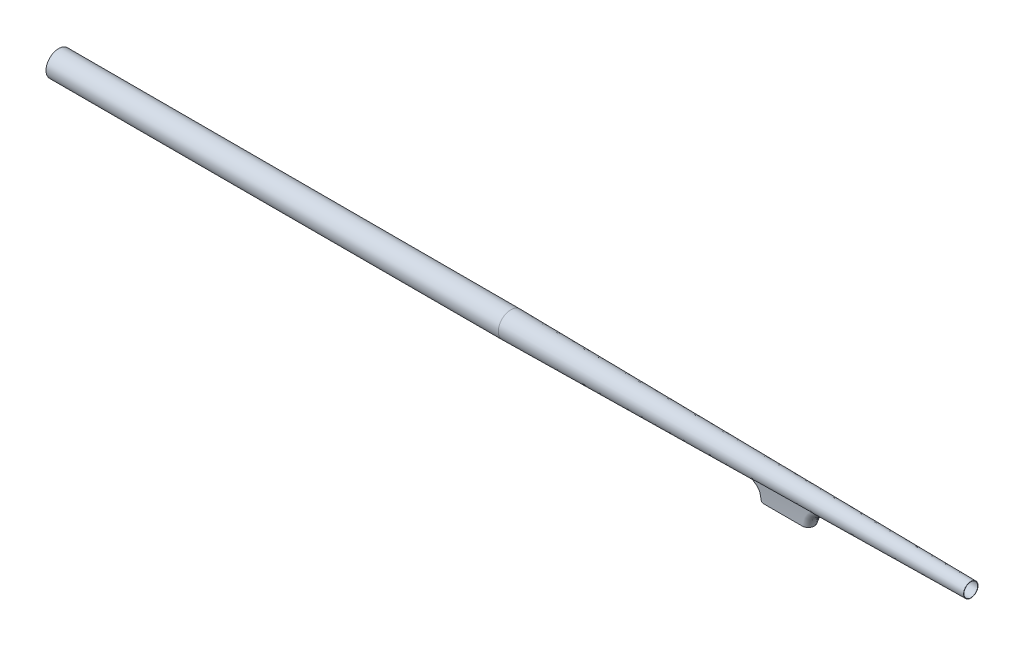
ISO-10303-21;
HEADER;
FILE_DESCRIPTION(('STEP AP214'),'2;1');
FILE_NAME('part.step','',(''),(''),'','','');
FILE_SCHEMA(('AUTOMOTIVE_DESIGN { 1 0 10303 214 1 1 1 1 }'));
ENDSEC;
DATA;
#1=APPLICATION_CONTEXT('core data for automotive mechanical design processes');
#2=APPLICATION_PROTOCOL_DEFINITION('international standard','automotive_design',2000,#1);
#3=PRODUCT_CONTEXT('',#1,'mechanical');
#4=PRODUCT('Part','Part','',(#3));
#5=PRODUCT_RELATED_PRODUCT_CATEGORY('part','',(#4));
#6=PRODUCT_DEFINITION_FORMATION('','',#4);
#7=PRODUCT_DEFINITION_CONTEXT('part definition',#1,'design');
#8=PRODUCT_DEFINITION('design','',#6,#7);
#9=PRODUCT_DEFINITION_SHAPE('','',#8);
#10=(LENGTH_UNIT() NAMED_UNIT(*) SI_UNIT(.MILLI.,.METRE.));
#11=(NAMED_UNIT(*) PLANE_ANGLE_UNIT() SI_UNIT($,.RADIAN.));
#12=(NAMED_UNIT(*) SI_UNIT($,.STERADIAN.) SOLID_ANGLE_UNIT());
#13=UNCERTAINTY_MEASURE_WITH_UNIT(LENGTH_MEASURE(1.E-05),#10,'distance_accuracy_value','');
#14=(GEOMETRIC_REPRESENTATION_CONTEXT(3) GLOBAL_UNCERTAINTY_ASSIGNED_CONTEXT((#13)) GLOBAL_UNIT_ASSIGNED_CONTEXT((#10,
#11,#12)) REPRESENTATION_CONTEXT('',''));
#15=CARTESIAN_POINT('',(0.,0.,0.));
#16=DIRECTION('',(0.,0.,1.));
#17=DIRECTION('',(1.,0.,0.));
#18=AXIS2_PLACEMENT_3D('',#15,#16,#17);
#19=CARTESIAN_POINT('',(438.206028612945,-15.,0.));
#20=DIRECTION('',(0.,1.,0.));
#21=DIRECTION('',(0.,0.,1.));
#22=AXIS2_PLACEMENT_3D('',#19,#20,#21);
#23=PLANE('',#22);
#24=CARTESIAN_POINT('',(459.999999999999,-15.,0.));
#25=CARTESIAN_POINT('',(459.999999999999,-15.,0.261795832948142));
#26=CARTESIAN_POINT('',(460.051960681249,-15.,0.784863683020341));
#27=CARTESIAN_POINT('',(460.279625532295,-15.,1.53881990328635));
#28=CARTESIAN_POINT('',(460.650855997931,-15.,2.23305646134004));
#29=CARTESIAN_POINT('',(461.149164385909,-15.,2.84280949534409));
#30=CARTESIAN_POINT('',(461.758063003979,-15.,3.3433151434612));
#31=CARTESIAN_POINT('',(462.453166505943,-15.,3.71725215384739));
#32=CARTESIAN_POINT('',(463.2100895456,-15.,3.94729927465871));
#33=CARTESIAN_POINT('',(463.736350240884,-15.,4.));
#34=CARTESIAN_POINT('',(466.079632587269,-15.,4.));
#35=CARTESIAN_POINT('',(470.23414091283,-15.,4.));
#36=CARTESIAN_POINT('',(476.466440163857,-15.,4.));
#37=CARTESIAN_POINT('',(482.714088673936,-15.,4.));
#38=CARTESIAN_POINT('',(486.899533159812,-15.,4.));
#39=CARTESIAN_POINT('',(489.253232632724,-15.,4.));
#40=CARTESIAN_POINT('',(489.763947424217,-15.,3.95120270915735));
#41=CARTESIAN_POINT('',(490.511536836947,-15.,3.73143385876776));
#42=CARTESIAN_POINT('',(491.209412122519,-15.,3.3649110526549));
#43=CARTESIAN_POINT('',(491.827753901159,-15.,2.86686439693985));
#44=CARTESIAN_POINT('',(492.336742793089,-15.,2.2525239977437));
#45=CARTESIAN_POINT('',(492.843291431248,-15.,1.31592925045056));
#46=CARTESIAN_POINT('',(492.999999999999,-15.,0.52360682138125));
#47=CARTESIAN_POINT('',(492.999999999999,-15.,-0.523590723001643));
#48=CARTESIAN_POINT('',(492.843300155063,-15.,-1.31590677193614));
#49=CARTESIAN_POINT('',(492.336751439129,-15.,-2.2525118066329));
#50=CARTESIAN_POINT('',(491.827757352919,-15.,-2.86686259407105));
#51=CARTESIAN_POINT('',(491.209405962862,-15.,-3.36491558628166));
#52=CARTESIAN_POINT('',(490.511522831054,-15.,-3.73143996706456));
#53=CARTESIAN_POINT('',(489.763933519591,-15.,-3.95120492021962));
#54=CARTESIAN_POINT('',(489.25322635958,-15.,-4.));
#55=CARTESIAN_POINT('',(486.899520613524,-15.,-4.));
#56=CARTESIAN_POINT('',(482.714058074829,-15.,-4.));
#57=CARTESIAN_POINT('',(476.46640158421,-15.,-4.));
#58=CARTESIAN_POINT('',(470.234111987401,-15.,-4.));
#59=CARTESIAN_POINT('',(466.079621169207,-15.,-4.));
#60=CARTESIAN_POINT('',(463.736344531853,-15.,-4.));
#61=CARTESIAN_POINT('',(463.210077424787,-15.,-3.9472973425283));
#62=CARTESIAN_POINT('',(462.453155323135,-15.,-3.71724699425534));
#63=CARTESIAN_POINT('',(461.758058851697,-15.,-3.34331189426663));
#64=CARTESIAN_POINT('',(461.149168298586,-15.,-2.84281214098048));
#65=CARTESIAN_POINT('',(460.650863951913,-15.,-2.23306783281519));
#66=CARTESIAN_POINT('',(460.279633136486,-15.,-1.53883751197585));
#67=CARTESIAN_POINT('',(460.051963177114,-15.,-0.784879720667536));
#68=CARTESIAN_POINT('',(459.999999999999,-15.,-0.261802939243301));
#69=CARTESIAN_POINT('',(459.999999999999,-15.,0.));
#70=B_SPLINE_CURVE_WITH_KNOTS('',3,(#24,#25,#26,#27,#28,#29,#30,#31,#32,#33,#34,#35,#36,#37,#38,
#39,#40,#41,#42,#43,#44,#45,#46,#47,#48,#49,#50,#51,#52,#53,#54,#55,#56,#57,#58,#59,#60,#61,#62,
#63,#64,#65,#66,#67,#68,#69),.UNSPECIFIED.,.T.,.F.,(4,1,1,1,1,1,1,1,2,1,1,1,2,1,1,1,1,1,1,2,1,1,
1,1,1,1,2,1,1,1,2,1,1,1,1,1,1,1,4),(0.,0.0106024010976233,0.0212048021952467,0.03180720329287,
0.0424096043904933,0.0530120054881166,0.0636144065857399,0.0742168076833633,0.0848192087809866,
0.168449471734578,0.252079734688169,0.33570999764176,0.419340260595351,0.429422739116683,
0.439505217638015,0.449587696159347,0.459670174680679,0.469752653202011,0.479835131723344,
0.500000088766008,0.520164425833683,0.530246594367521,0.540328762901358,0.550410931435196,
0.560493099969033,0.570575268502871,0.580657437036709,0.6642876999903,0.747917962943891,
0.831548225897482,0.915178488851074,0.925781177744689,0.936383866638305,0.946986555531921,
0.957589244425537,0.968191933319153,0.978794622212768,0.989397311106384,1.),.UNSPECIFIED.);
#71=CARTESIAN_POINT('',(459.999999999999,-15.,0.));
#72=VERTEX_POINT('',#71);
#73=EDGE_CURVE('E13',#72,#72,#70,.T.);
#74=ORIENTED_EDGE('',*,*,#73,.T.);
#75=EDGE_LOOP('',(#74));
#76=FACE_BOUND('',#75,.T.);
#77=ADVANCED_FACE('F135',(#76),#23,.T.);
#78=OPEN_SHELL('',(#77));
#79=SHELL_BASED_SURFACE_MODEL('B2',(#78));
#80=CARTESIAN_POINT('',(459.999999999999,-15.,0.));
#81=CARTESIAN_POINT('',(459.908409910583,-13.3668218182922,0.));
#82=CARTESIAN_POINT('',(459.698533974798,-9.62444312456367,0.));
#83=CARTESIAN_POINT('',(456.517982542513,-7.52166170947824,0.));
#84=CARTESIAN_POINT('',(454.725427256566,-6.33653641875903,7.5308370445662E-08));
#85=CARTESIAN_POINT('',(459.999999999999,-15.,0.261795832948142));
#86=CARTESIAN_POINT('',(459.908412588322,-13.3668189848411,0.277964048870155));
#87=CARTESIAN_POINT('',(459.698543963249,-9.62443255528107,0.315013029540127));
#88=CARTESIAN_POINT('',(456.518001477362,-7.52164167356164,0.352062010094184));
#89=CARTESIAN_POINT('',(454.725451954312,-6.33651028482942,0.372942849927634));
#90=CARTESIAN_POINT('',(460.051960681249,-15.,0.784863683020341));
#91=CARTESIAN_POINT('',(459.96374223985,-13.3565644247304,0.833414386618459));
#92=CARTESIAN_POINT('',(459.761599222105,-9.59068003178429,0.9446668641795));
#93=CARTESIAN_POINT('',(456.593540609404,-7.46436807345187,1.05591934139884));
#94=CARTESIAN_POINT('',(454.808028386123,-6.26597879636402,1.11862117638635));
#95=CARTESIAN_POINT('',(460.279625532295,-15.,1.53881990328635));
#96=CARTESIAN_POINT('',(460.202890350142,-13.3155031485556,1.62892438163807));
#97=CARTESIAN_POINT('',(460.027079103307,-9.4555354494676,1.83539608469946));
#98=CARTESIAN_POINT('',(456.906149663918,-7.235049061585,2.0418677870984));
#99=CARTESIAN_POINT('',(455.147201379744,-5.9835812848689,2.15823501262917));
#100=CARTESIAN_POINT('',(460.650855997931,-15.,2.23305646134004));
#101=CARTESIAN_POINT('',(460.588073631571,-13.2538864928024,2.35412468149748));
#102=CARTESIAN_POINT('',(460.444262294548,-9.25274042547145,2.63154886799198));
#103=CARTESIAN_POINT('',(457.389185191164,-6.89093059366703,2.90897305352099));
#104=CARTESIAN_POINT('',(455.667353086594,-5.55981143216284,3.06532892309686));
#105=CARTESIAN_POINT('',(461.149164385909,-15.,2.84280949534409));
#106=CARTESIAN_POINT('',(461.098936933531,-13.1802603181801,2.98577664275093));
#107=CARTESIAN_POINT('',(460.983931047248,-9.01042308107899,3.31338156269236));
#108=CARTESIAN_POINT('',(458.003961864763,-6.47972555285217,3.64098648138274));
#109=CARTESIAN_POINT('',(456.324462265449,-5.0534200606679,3.82562402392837));
#110=CARTESIAN_POINT('',(461.758063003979,-15.,3.3433151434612));
#111=CARTESIAN_POINT('',(461.717639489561,-13.1005216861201,3.50245775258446));
#112=CARTESIAN_POINT('',(461.625143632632,-8.74799309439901,3.86712825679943));
#113=CARTESIAN_POINT('',(458.725832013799,-6.03435873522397,4.23179875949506));
#114=CARTESIAN_POINT('',(457.091792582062,-4.50494906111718,4.43732625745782));
#115=CARTESIAN_POINT('',(462.453166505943,-15.,3.71725215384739));
#116=CARTESIAN_POINT('',(462.422911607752,-13.0233690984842,3.88937122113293));
#117=CARTESIAN_POINT('',(462.353769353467,-8.49408100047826,4.28377688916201));
#118=CARTESIAN_POINT('',(459.547198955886,-5.60339521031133,4.67818255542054));
#119=CARTESIAN_POINT('',(457.965429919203,-3.97419857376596,4.90046855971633));
#120=CARTESIAN_POINT('',(463.2100895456,-15.,3.94729927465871));
#121=CARTESIAN_POINT('',(463.195130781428,-12.9593569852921,4.13034861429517));
#122=CARTESIAN_POINT('',(463.161099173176,-8.28342606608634,4.54980067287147));
#123=CARTESIAN_POINT('',(460.46966214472,-5.24576158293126,4.96925272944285));
#124=CARTESIAN_POINT('',(458.95278358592,-3.53372714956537,5.20565462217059));
#125=CARTESIAN_POINT('',(463.736350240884,-15.,4.));
#126=CARTESIAN_POINT('',(463.738578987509,-12.9399059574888,4.1859848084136));
#127=CARTESIAN_POINT('',(463.743976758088,-8.2194331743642,4.61216340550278));
#128=CARTESIAN_POINT('',(461.152004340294,-5.13697528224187,5.03834200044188));
#129=CARTESIAN_POINT('',(459.691184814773,-3.39969494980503,5.27853479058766));
#130=CARTESIAN_POINT('',(466.079632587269,-15.,4.));
#131=CARTESIAN_POINT('',(466.15589480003,-12.9384777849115,4.18039845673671));
#132=CARTESIAN_POINT('',(466.331146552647,-8.21487130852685,4.59377609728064));
#133=CARTESIAN_POINT('',(464.189782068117,-5.12810418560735,5.0071537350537));
#134=CARTESIAN_POINT('',(462.982928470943,-3.38839374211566,5.24013111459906));
#135=CARTESIAN_POINT('',(470.23414091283,-15.,4.));
#136=CARTESIAN_POINT('',(470.398998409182,-12.9360706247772,4.17047115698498));
#137=CARTESIAN_POINT('',(470.777771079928,-8.20729929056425,4.56110068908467));
#138=CARTESIAN_POINT('',(469.533730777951,-5.11247307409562,4.95173021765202));
#139=CARTESIAN_POINT('',(468.832612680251,-3.36822175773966,5.17188479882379));
#140=CARTESIAN_POINT('',(476.466440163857,-15.,4.));
#141=CARTESIAN_POINT('',(476.698090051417,-12.9326334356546,4.15558148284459));
#142=CARTESIAN_POINT('',(477.230876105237,-8.19666782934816,4.51209177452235));
#143=CARTESIAN_POINT('',(477.471065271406,-5.08911048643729,4.86860206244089));
#144=CARTESIAN_POINT('',(477.60645844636,-3.33769167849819,5.06952326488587));
#145=CARTESIAN_POINT('',(482.714088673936,-15.,4.));
#146=CARTESIAN_POINT('',(483.008780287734,-12.9291602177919,4.14072920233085));
#147=CARTESIAN_POINT('',(483.686971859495,-8.18591494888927,4.46320593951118));
#148=CARTESIAN_POINT('',(485.395388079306,-5.0655731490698,4.78568267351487));
#149=CARTESIAN_POINT('',(486.358268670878,-3.30695733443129,4.96741881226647));
#150=CARTESIAN_POINT('',(486.899533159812,-15.,4.));
#151=CARTESIAN_POINT('',(487.275334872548,-12.9266810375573,4.13087609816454));
#152=CARTESIAN_POINT('',(488.139868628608,-8.17810021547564,4.43077474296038));
#153=CARTESIAN_POINT('',(490.713641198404,-5.0495927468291,4.73067338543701));
#154=CARTESIAN_POINT('',(492.164230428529,-3.28637707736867,4.89968259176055));
#155=CARTESIAN_POINT('',(489.253232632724,-15.,4.));
#156=CARTESIAN_POINT('',(489.697081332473,-12.9252070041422,4.12537543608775));
#157=CARTESIAN_POINT('',(490.717730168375,-8.17338240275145,4.41266947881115));
#158=CARTESIAN_POINT('',(493.715774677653,-5.04051000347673,4.69996351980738));
#159=CARTESIAN_POINT('',(495.40547953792,-3.27483364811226,4.8618680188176));
#160=CARTESIAN_POINT('',(489.763947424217,-15.,3.95120270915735));
#161=CARTESIAN_POINT('',(490.220931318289,-12.94232127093,4.07122838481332));
#162=CARTESIAN_POINT('',(491.271717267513,-8.22974076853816,4.34626361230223));
#163=CARTESIAN_POINT('',(494.354687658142,-5.13588327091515,4.62129883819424));
#164=CARTESIAN_POINT('',(496.092255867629,-3.39219548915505,4.77629412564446));
#165=CARTESIAN_POINT('',(490.511536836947,-15.,3.73143385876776));
#166=CARTESIAN_POINT('',(490.974491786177,-12.998555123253,3.83887345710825));
#167=CARTESIAN_POINT('',(492.039010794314,-8.41486879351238,4.08506806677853));
#168=CARTESIAN_POINT('',(495.208638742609,-5.44959997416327,4.33126267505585));
#169=CARTESIAN_POINT('',(496.99504583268,-3.77838419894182,4.47000321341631));
#170=CARTESIAN_POINT('',(491.209412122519,-15.,3.3649110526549));
#171=CARTESIAN_POINT('',(491.671002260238,-13.0657513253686,3.46111569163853));
#172=CARTESIAN_POINT('',(492.73243728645,-8.6360738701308,3.68156572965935));
#173=CARTESIAN_POINT('',(495.962126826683,-5.82454888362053,3.90201576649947));
#174=CARTESIAN_POINT('',(497.782383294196,-4.23998236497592,4.02624651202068));
#175=CARTESIAN_POINT('',(491.827753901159,-15.,2.86686439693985));
#176=CARTESIAN_POINT('',(492.286574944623,-13.1345818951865,2.95256067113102));
#177=CARTESIAN_POINT('',(493.341700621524,-8.86265294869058,3.14893110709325));
#178=CARTESIAN_POINT('',(496.61792718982,-6.20865403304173,3.34530154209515));
#179=CARTESIAN_POINT('',(498.464410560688,-4.71286825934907,3.45596089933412));
#180=CARTESIAN_POINT('',(492.336742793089,-15.,2.2525239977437));
#181=CARTESIAN_POINT('',(492.796145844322,-13.1977427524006,2.32620797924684));
#182=CARTESIAN_POINT('',(493.852633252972,-9.07056459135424,2.49505260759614));
#183=CARTESIAN_POINT('',(497.172248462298,-6.56113877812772,2.66389723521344));
#184=CARTESIAN_POINT('',(499.043184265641,-5.14683328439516,2.75904295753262));
#185=CARTESIAN_POINT('',(492.843291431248,-15.,1.31592925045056));
#186=CARTESIAN_POINT('',(493.307753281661,-13.2677902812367,1.3672251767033));
#187=CARTESIAN_POINT('',(494.375859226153,-9.30114200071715,1.48476824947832));
#188=CARTESIAN_POINT('',(497.748009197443,-6.95207169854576,1.60231132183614));
#189=CARTESIAN_POINT('',(499.648551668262,-5.62814085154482,1.66854342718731));
#190=CARTESIAN_POINT('',(492.999999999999,-15.,0.52360682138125));
#191=CARTESIAN_POINT('',(493.470407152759,-13.2942484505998,0.545447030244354));
#192=CARTESIAN_POINT('',(494.552143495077,-9.38823237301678,0.59549321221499));
#193=CARTESIAN_POINT('',(497.950821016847,-7.0997370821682,0.645539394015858));
#194=CARTESIAN_POINT('',(499.866312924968,-5.80994478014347,0.673730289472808));
#195=CARTESIAN_POINT('',(492.999999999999,-15.,-0.523590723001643));
#196=CARTESIAN_POINT('',(493.470396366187,-13.2942362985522,-0.545430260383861));
#197=CARTESIAN_POINT('',(494.552104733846,-9.38818870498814,-0.595474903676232));
#198=CARTESIAN_POINT('',(497.95074974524,-7.09965678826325,-0.645519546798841));
#199=CARTESIAN_POINT('',(499.866221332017,-5.80984159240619,-0.67373972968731));
#200=CARTESIAN_POINT('',(492.843300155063,-15.,-1.31590677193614));
#201=CARTESIAN_POINT('',(493.307813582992,-13.2678324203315,-1.36721137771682));
#202=CARTESIAN_POINT('',(494.376029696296,-9.30127225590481,-1.48477433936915));
#203=CARTESIAN_POINT('',(497.748279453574,-6.95227830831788,-1.60233730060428));
#204=CARTESIAN_POINT('',(499.648873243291,-5.62838531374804,-1.66861069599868));
#205=CARTESIAN_POINT('',(492.336751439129,-15.,-2.2525118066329));
#206=CARTESIAN_POINT('',(492.796139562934,-13.1977407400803,-2.32616479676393));
#207=CARTESIAN_POINT('',(493.852578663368,-9.07054449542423,-2.49493840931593));
#208=CARTESIAN_POINT('',(497.172129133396,-6.5610818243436,-2.66371202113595));
#209=CARTESIAN_POINT('',(499.043019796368,-5.14674729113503,-2.75884756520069));
#210=CARTESIAN_POINT('',(491.827757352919,-15.,-2.86686259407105));
#211=CARTESIAN_POINT('',(492.286621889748,-13.1346017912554,-2.95256197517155));
#212=CARTESIAN_POINT('',(493.341828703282,-8.86270183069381,-3.14893953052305));
#213=CARTESIAN_POINT('',(496.618116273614,-6.208708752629,-3.34531708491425));
#214=CARTESIAN_POINT('',(498.464622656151,-4.7129160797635,-3.45601005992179));
#215=CARTESIAN_POINT('',(491.209405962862,-15.,-3.36491558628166));
#216=CARTESIAN_POINT('',(491.670990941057,-13.0657915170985,-3.46106229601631));
#217=CARTESIAN_POINT('',(492.732391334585,-8.63618702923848,-3.681379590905));
#218=CARTESIAN_POINT('',(495.962023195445,-5.82470833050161,-3.90169688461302));
#219=CARTESIAN_POINT('',(497.782233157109,-4.24015616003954,-4.02588211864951));
#220=CARTESIAN_POINT('',(490.511522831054,-15.,-3.73143996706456));
#221=CARTESIAN_POINT('',(490.974534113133,-12.9985538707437,-3.83889842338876));
#222=CARTESIAN_POINT('',(492.039155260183,-8.41484359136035,-4.0851362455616));
#223=CARTESIAN_POINT('',(495.208860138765,-5.44952141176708,-4.33137406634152));
#224=CARTESIAN_POINT('',(496.995294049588,-3.778262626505,-4.47016789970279));
#225=CARTESIAN_POINT('',(489.763933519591,-15.,-3.95120492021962));
#226=CARTESIAN_POINT('',(490.220908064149,-12.942440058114,-4.0711339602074));
#227=CARTESIAN_POINT('',(491.271641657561,-8.23010927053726,-4.34594774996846));
#228=CARTESIAN_POINT('',(494.354533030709,-5.13647010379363,-4.62076153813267));
#229=CARTESIAN_POINT('',(496.092037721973,-3.39289157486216,-4.77566054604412));
#230=CARTESIAN_POINT('',(489.25322635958,-15.,-4.));
#231=CARTESIAN_POINT('',(489.697098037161,-12.9252249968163,-4.12537132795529));
#232=CARTESIAN_POINT('',(490.717766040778,-8.17341855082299,-4.41265595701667));
#233=CARTESIAN_POINT('',(493.715802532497,-5.04053208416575,-4.69994058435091));
#234=CARTESIAN_POINT('',(495.405482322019,-3.27483363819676,-4.86186798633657));
#235=CARTESIAN_POINT('',(486.899520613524,-15.,-4.));
#236=CARTESIAN_POINT('',(487.275355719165,-12.9267005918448,-4.13087218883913));
#237=CARTESIAN_POINT('',(488.139920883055,-8.17813949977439,-4.43076187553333));
#238=CARTESIAN_POINT('',(490.713688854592,-5.0496167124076,-4.73065155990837));
#239=CARTESIAN_POINT('',(492.164247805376,-3.28637701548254,-4.89968238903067));
#240=CARTESIAN_POINT('',(482.714058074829,-15.,-4.));
#241=CARTESIAN_POINT('',(483.008800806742,-12.9291738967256,-4.1407258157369));
#242=CARTESIAN_POINT('',(483.687047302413,-8.18594242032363,-4.46319479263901));
#243=CARTESIAN_POINT('',(485.395467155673,-5.0655898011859,-4.7856637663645));
#244=CARTESIAN_POINT('',(486.358311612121,-3.3069571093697,-4.96741831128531));
#245=CARTESIAN_POINT('',(476.46640158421,-15.,-4.));
#246=CARTESIAN_POINT('',(476.698113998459,-12.9326260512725,-4.15557917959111));
#247=CARTESIAN_POINT('',(477.230968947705,-8.19665302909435,-4.5120841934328));
#248=CARTESIAN_POINT('',(477.471162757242,-5.08910131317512,-4.86858920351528));
#249=CARTESIAN_POINT('',(477.606512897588,-3.33769149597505,-5.06952262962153));
#250=CARTESIAN_POINT('',(470.234111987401,-15.,-4.));
#251=CARTESIAN_POINT('',(470.399026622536,-12.9360435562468,-4.17046998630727));
#252=CARTESIAN_POINT('',(470.777859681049,-8.20724498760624,-4.56109683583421));
#253=CARTESIAN_POINT('',(469.533816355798,-5.11243981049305,-4.95172368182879));
#254=CARTESIAN_POINT('',(468.832653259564,-3.36822168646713,-5.17188432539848));
#255=CARTESIAN_POINT('',(466.079621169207,-15.,-4.));
#256=CARTESIAN_POINT('',(466.155924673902,-12.9384476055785,-4.1803979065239));
#257=CARTESIAN_POINT('',(466.331215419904,-8.21481075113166,-4.59377428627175));
#258=CARTESIAN_POINT('',(464.189838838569,-5.12806711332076,-5.00715066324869));
#259=CARTESIAN_POINT('',(462.982944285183,-3.38839368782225,-5.24013093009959));
#260=CARTESIAN_POINT('',(463.736344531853,-15.,-4.));
#261=CARTESIAN_POINT('',(463.738601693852,-12.9398794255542,-4.18598453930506));
#262=CARTESIAN_POINT('',(463.744021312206,-8.21937994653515,-4.61216251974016));
#263=CARTESIAN_POINT('',(461.152029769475,-5.13694274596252,-5.03834049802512));
#264=CARTESIAN_POINT('',(459.691172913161,-3.39969499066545,-5.27853492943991));
#265=CARTESIAN_POINT('',(463.210077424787,-15.,-3.9472973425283));
#266=CARTESIAN_POINT('',(463.195098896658,-12.9591987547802,-4.1304719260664));
#267=CARTESIAN_POINT('',(463.160981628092,-8.2829381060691,-4.55021097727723));
#268=CARTESIAN_POINT('',(460.469419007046,-5.24498955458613,-4.96995002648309));
#269=CARTESIAN_POINT('',(458.952444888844,-3.53281516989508,-5.20651531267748));
#270=CARTESIAN_POINT('',(462.453155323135,-15.,-3.71724699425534));
#271=CARTESIAN_POINT('',(462.422970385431,-13.0233723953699,-3.88932007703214));
#272=CARTESIAN_POINT('',(462.353952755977,-8.49412219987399,-4.28362037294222));
#273=CARTESIAN_POINT('',(459.547469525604,-5.60351650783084,-4.67792066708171));
#274=CARTESIAN_POINT('',(457.965727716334,-3.97438362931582,-4.90014846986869));
#275=CARTESIAN_POINT('',(461.758058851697,-15.,-3.34331189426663));
#276=CARTESIAN_POINT('',(461.717598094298,-13.1004754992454,-3.50255653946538));
#277=CARTESIAN_POINT('',(461.624986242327,-8.74786825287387,-3.8674608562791));
#278=CARTESIAN_POINT('',(458.725524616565,-6.03419304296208,-4.23236517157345));
#279=CARTESIAN_POINT('',(457.091381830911,-4.50477701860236,-4.43802523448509));
#280=CARTESIAN_POINT('',(461.149168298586,-15.,-2.84281214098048));
#281=CARTESIAN_POINT('',(461.098999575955,-13.1802385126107,-2.98574052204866));
#282=CARTESIAN_POINT('',(460.984103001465,-9.01037462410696,-3.31325661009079));
#283=CARTESIAN_POINT('',(458.00421359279,-6.47968288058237,-3.64077269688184));
#284=CARTESIAN_POINT('',(456.324743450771,-5.05339495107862,-3.82536062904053));
#285=CARTESIAN_POINT('',(460.650863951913,-15.,-2.23306783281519));
#286=CARTESIAN_POINT('',(460.588013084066,-13.2539113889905,-2.35421813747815));
#287=CARTESIAN_POINT('',(460.44402526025,-9.2528410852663,-2.6318304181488));
#288=CARTESIAN_POINT('',(457.38874769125,-6.89113305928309,-2.90944269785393));
#289=CARTESIAN_POINT('',(455.666790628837,-5.56008275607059,-3.06590476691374));
#290=CARTESIAN_POINT('',(460.279633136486,-15.,-1.53883751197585));
#291=CARTESIAN_POINT('',(460.202945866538,-13.315472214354,-1.62891063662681));
#292=CARTESIAN_POINT('',(460.027231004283,-9.45544697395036,-1.83531049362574));
#293=CARTESIAN_POINT('',(456.906380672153,-7.2349216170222,-2.0417103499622));
#294=CARTESIAN_POINT('',(455.147468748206,-5.98344006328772,-2.15803707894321));
#295=CARTESIAN_POINT('',(460.051963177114,-15.,-0.784879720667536));
#296=CARTESIAN_POINT('',(459.963674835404,-13.3566131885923,-0.833457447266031));
#297=CARTESIAN_POINT('',(459.761364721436,-9.59084770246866,-0.944771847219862));
#298=CARTESIAN_POINT('',(456.593129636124,-7.46466462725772,-1.05608624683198));
#299=CARTESIAN_POINT('',(454.807513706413,-6.26635238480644,-1.11882285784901));
#300=CARTESIAN_POINT('',(459.999999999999,-15.,-0.261802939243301));
#301=CARTESIAN_POINT('',(459.90840723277,-13.3668246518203,-0.277971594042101));
#302=CARTESIAN_POINT('',(459.698523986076,-9.62445369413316,-0.31502158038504));
#303=CARTESIAN_POINT('',(456.51796360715,-7.52168174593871,-0.352071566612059));
#304=CARTESIAN_POINT('',(454.72540255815,-6.33656255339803,-0.37295282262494));
#305=CARTESIAN_POINT('',(459.999999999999,-15.,0.));
#306=CARTESIAN_POINT('',(459.908409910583,-13.3668218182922,0.));
#307=CARTESIAN_POINT('',(459.698533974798,-9.62444312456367,0.));
#308=CARTESIAN_POINT('',(456.517982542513,-7.52166170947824,0.));
#309=CARTESIAN_POINT('',(454.725427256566,-6.33653641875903,7.5308370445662E-08));
#310=B_SPLINE_SURFACE_WITH_KNOTS('',3,3,((#80,#81,#82,#83,#84),(#85,#86,#87,#88,#89),(#90,#91,
#92,#93,#94),(#95,#96,#97,#98,#99),(#100,#101,#102,#103,#104),(#105,#106,#107,#108,#109),(#110,
#111,#112,#113,#114),(#115,#116,#117,#118,#119),(#120,#121,#122,#123,#124),(#125,#126,#127,#128,
#129),(#130,#131,#132,#133,#134),(#135,#136,#137,#138,#139),(#140,#141,#142,#143,#144),(#145,
#146,#147,#148,#149),(#150,#151,#152,#153,#154),(#155,#156,#157,#158,#159),(#160,#161,#162,#163,
#164),(#165,#166,#167,#168,#169),(#170,#171,#172,#173,#174),(#175,#176,#177,#178,#179),(#180,
#181,#182,#183,#184),(#185,#186,#187,#188,#189),(#190,#191,#192,#193,#194),(#195,#196,#197,#198,
#199),(#200,#201,#202,#203,#204),(#205,#206,#207,#208,#209),(#210,#211,#212,#213,#214),(#215,
#216,#217,#218,#219),(#220,#221,#222,#223,#224),(#225,#226,#227,#228,#229),(#230,#231,#232,#233,
#234),(#235,#236,#237,#238,#239),(#240,#241,#242,#243,#244),(#245,#246,#247,#248,#249),(#250,
#251,#252,#253,#254),(#255,#256,#257,#258,#259),(#260,#261,#262,#263,#264),(#265,#266,#267,#268,
#269),(#270,#271,#272,#273,#274),(#275,#276,#277,#278,#279),(#280,#281,#282,#283,#284),(#285,
#286,#287,#288,#289),(#290,#291,#292,#293,#294),(#295,#296,#297,#298,#299),(#300,#301,#302,#303,
#304),(#305,#306,#307,#308,#309)),.UNSPECIFIED.,.T.,.F.,.F.,(4,1,1,1,1,1,1,1,2,1,1,1,2,1,1,1,1,
1,1,2,1,1,1,1,1,1,2,1,1,1,2,1,1,1,1,1,1,1,4),(4,1,4),(0.,0.0106024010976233,0.0212048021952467,
0.03180720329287,0.0424096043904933,0.0530120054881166,0.0636144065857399,0.0742168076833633,
0.0848192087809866,0.168449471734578,0.252079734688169,0.33570999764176,0.419340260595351,
0.429422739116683,0.439505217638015,0.449587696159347,0.459670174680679,0.469752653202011,
0.479835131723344,0.500000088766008,0.520164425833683,0.530246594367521,0.540328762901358,
0.550410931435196,0.560493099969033,0.570575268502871,0.580657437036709,0.6642876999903,
0.747917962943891,0.831548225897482,0.915178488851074,0.925781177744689,0.936383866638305,
0.946986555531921,0.957589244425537,0.968191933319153,0.978794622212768,0.989397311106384,1.),
(0.,0.436401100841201,1.),.UNSPECIFIED.);
#311=CARTESIAN_POINT('',(459.999999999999,-15.,0.));
#312=CARTESIAN_POINT('',(459.999999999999,-15.,0.261795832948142));
#313=CARTESIAN_POINT('',(460.051960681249,-15.,0.784863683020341));
#314=CARTESIAN_POINT('',(460.279625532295,-15.,1.53881990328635));
#315=CARTESIAN_POINT('',(460.650855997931,-15.,2.23305646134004));
#316=CARTESIAN_POINT('',(461.149164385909,-15.,2.84280949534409));
#317=CARTESIAN_POINT('',(461.758063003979,-15.,3.3433151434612));
#318=CARTESIAN_POINT('',(462.453166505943,-15.,3.71725215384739));
#319=CARTESIAN_POINT('',(463.2100895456,-15.,3.94729927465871));
#320=CARTESIAN_POINT('',(463.736350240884,-15.,4.));
#321=CARTESIAN_POINT('',(466.079632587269,-15.,4.));
#322=CARTESIAN_POINT('',(470.23414091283,-15.,4.));
#323=CARTESIAN_POINT('',(476.466440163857,-15.,4.));
#324=CARTESIAN_POINT('',(482.714088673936,-15.,4.));
#325=CARTESIAN_POINT('',(486.899533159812,-15.,4.));
#326=CARTESIAN_POINT('',(489.253232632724,-15.,4.));
#327=CARTESIAN_POINT('',(489.763947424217,-15.,3.95120270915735));
#328=CARTESIAN_POINT('',(490.511536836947,-15.,3.73143385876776));
#329=CARTESIAN_POINT('',(491.209412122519,-15.,3.3649110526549));
#330=CARTESIAN_POINT('',(491.827753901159,-15.,2.86686439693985));
#331=CARTESIAN_POINT('',(492.336742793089,-15.,2.2525239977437));
#332=CARTESIAN_POINT('',(492.843291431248,-15.,1.31592925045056));
#333=CARTESIAN_POINT('',(492.999999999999,-15.,0.52360682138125));
#334=CARTESIAN_POINT('',(492.999999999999,-15.,-0.523590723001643));
#335=CARTESIAN_POINT('',(492.843300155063,-15.,-1.31590677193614));
#336=CARTESIAN_POINT('',(492.336751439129,-15.,-2.2525118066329));
#337=CARTESIAN_POINT('',(491.827757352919,-15.,-2.86686259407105));
#338=CARTESIAN_POINT('',(491.209405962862,-15.,-3.36491558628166));
#339=CARTESIAN_POINT('',(490.511522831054,-15.,-3.73143996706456));
#340=CARTESIAN_POINT('',(489.763933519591,-15.,-3.95120492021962));
#341=CARTESIAN_POINT('',(489.25322635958,-15.,-4.));
#342=CARTESIAN_POINT('',(486.899520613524,-15.,-4.));
#343=CARTESIAN_POINT('',(482.714058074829,-15.,-4.));
#344=CARTESIAN_POINT('',(476.46640158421,-15.,-4.));
#345=CARTESIAN_POINT('',(470.234111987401,-15.,-4.));
#346=CARTESIAN_POINT('',(466.079621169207,-15.,-4.));
#347=CARTESIAN_POINT('',(463.736344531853,-15.,-4.));
#348=CARTESIAN_POINT('',(463.210077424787,-15.,-3.9472973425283));
#349=CARTESIAN_POINT('',(462.453155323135,-15.,-3.71724699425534));
#350=CARTESIAN_POINT('',(461.758058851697,-15.,-3.34331189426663));
#351=CARTESIAN_POINT('',(461.149168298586,-15.,-2.84281214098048));
#352=CARTESIAN_POINT('',(460.650863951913,-15.,-2.23306783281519));
#353=CARTESIAN_POINT('',(460.279633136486,-15.,-1.53883751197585));
#354=CARTESIAN_POINT('',(460.051963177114,-15.,-0.784879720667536));
#355=CARTESIAN_POINT('',(459.999999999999,-15.,-0.261802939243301));
#356=CARTESIAN_POINT('',(459.999999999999,-15.,0.));
#357=B_SPLINE_CURVE_WITH_KNOTS('',3,(#311,#312,#313,#314,#315,#316,#317,#318,#319,#320,#321,
#322,#323,#324,#325,#326,#327,#328,#329,#330,#331,#332,#333,#334,#335,#336,#337,#338,#339,#340,
#341,#342,#343,#344,#345,#346,#347,#348,#349,#350,#351,#352,#353,#354,#355,#356),.UNSPECIFIED.,
.T.,.F.,(4,1,1,1,1,1,1,1,2,1,1,1,2,1,1,1,1,1,1,2,1,1,1,1,1,1,2,1,1,1,2,1,1,1,1,1,1,1,4),(0.,
0.0106024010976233,0.0212048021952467,0.03180720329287,0.0424096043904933,0.0530120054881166,
0.0636144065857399,0.0742168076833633,0.0848192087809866,0.168449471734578,0.252079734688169,
0.33570999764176,0.419340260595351,0.429422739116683,0.439505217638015,0.449587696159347,
0.459670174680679,0.469752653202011,0.479835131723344,0.500000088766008,0.520164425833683,
0.530246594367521,0.540328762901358,0.550410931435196,0.560493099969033,0.570575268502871,
0.580657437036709,0.6642876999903,0.747917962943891,0.831548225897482,0.915178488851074,
0.925781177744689,0.936383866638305,0.946986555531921,0.957589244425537,0.968191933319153,
0.978794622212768,0.989397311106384,1.),.UNSPECIFIED.);
#358=CARTESIAN_POINT('',(459.999999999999,-15.,0.));
#359=VERTEX_POINT('',#358);
#360=EDGE_CURVE('E134',#359,#359,#357,.T.);
#361=CARTESIAN_POINT('',(454.725427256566,-6.33653641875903,7.5308370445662E-08));
#362=CARTESIAN_POINT('',(454.725451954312,-6.33651028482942,0.372942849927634));
#363=CARTESIAN_POINT('',(454.808028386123,-6.26597879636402,1.11862117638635));
#364=CARTESIAN_POINT('',(455.147201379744,-5.9835812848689,2.15823501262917));
#365=CARTESIAN_POINT('',(455.667353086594,-5.55981143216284,3.06532892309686));
#366=CARTESIAN_POINT('',(456.324462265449,-5.0534200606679,3.82562402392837));
#367=CARTESIAN_POINT('',(457.091792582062,-4.50494906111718,4.43732625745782));
#368=CARTESIAN_POINT('',(457.965429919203,-3.97419857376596,4.90046855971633));
#369=CARTESIAN_POINT('',(458.95278358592,-3.53372714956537,5.20565462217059));
#370=CARTESIAN_POINT('',(459.691184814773,-3.39969494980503,5.27853479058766));
#371=CARTESIAN_POINT('',(462.982928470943,-3.38839374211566,5.24013111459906));
#372=CARTESIAN_POINT('',(468.832612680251,-3.36822175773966,5.17188479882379));
#373=CARTESIAN_POINT('',(477.60645844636,-3.33769167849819,5.06952326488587));
#374=CARTESIAN_POINT('',(486.358268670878,-3.30695733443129,4.96741881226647));
#375=CARTESIAN_POINT('',(492.164230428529,-3.28637707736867,4.89968259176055));
#376=CARTESIAN_POINT('',(495.40547953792,-3.27483364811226,4.8618680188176));
#377=CARTESIAN_POINT('',(496.092255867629,-3.39219548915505,4.77629412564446));
#378=CARTESIAN_POINT('',(496.99504583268,-3.77838419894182,4.47000321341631));
#379=CARTESIAN_POINT('',(497.782383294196,-4.23998236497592,4.02624651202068));
#380=CARTESIAN_POINT('',(498.464410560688,-4.71286825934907,3.45596089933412));
#381=CARTESIAN_POINT('',(499.043184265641,-5.14683328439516,2.75904295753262));
#382=CARTESIAN_POINT('',(499.648551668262,-5.62814085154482,1.66854342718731));
#383=CARTESIAN_POINT('',(499.866312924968,-5.80994478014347,0.673730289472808));
#384=CARTESIAN_POINT('',(499.866221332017,-5.80984159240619,-0.67373972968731));
#385=CARTESIAN_POINT('',(499.648873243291,-5.62838531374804,-1.66861069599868));
#386=CARTESIAN_POINT('',(499.043019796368,-5.14674729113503,-2.75884756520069));
#387=CARTESIAN_POINT('',(498.464622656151,-4.7129160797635,-3.45601005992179));
#388=CARTESIAN_POINT('',(497.782233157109,-4.24015616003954,-4.02588211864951));
#389=CARTESIAN_POINT('',(496.995294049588,-3.778262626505,-4.47016789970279));
#390=CARTESIAN_POINT('',(496.092037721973,-3.39289157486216,-4.77566054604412));
#391=CARTESIAN_POINT('',(495.405482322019,-3.27483363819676,-4.86186798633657));
#392=CARTESIAN_POINT('',(492.164247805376,-3.28637701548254,-4.89968238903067));
#393=CARTESIAN_POINT('',(486.358311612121,-3.3069571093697,-4.96741831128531));
#394=CARTESIAN_POINT('',(477.606512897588,-3.33769149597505,-5.06952262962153));
#395=CARTESIAN_POINT('',(468.832653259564,-3.36822168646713,-5.17188432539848));
#396=CARTESIAN_POINT('',(462.982944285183,-3.38839368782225,-5.24013093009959));
#397=CARTESIAN_POINT('',(459.691172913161,-3.39969499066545,-5.27853492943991));
#398=CARTESIAN_POINT('',(458.952444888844,-3.53281516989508,-5.20651531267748));
#399=CARTESIAN_POINT('',(457.965727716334,-3.97438362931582,-4.90014846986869));
#400=CARTESIAN_POINT('',(457.091381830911,-4.50477701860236,-4.43802523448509));
#401=CARTESIAN_POINT('',(456.324743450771,-5.05339495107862,-3.82536062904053));
#402=CARTESIAN_POINT('',(455.666790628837,-5.56008275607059,-3.06590476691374));
#403=CARTESIAN_POINT('',(455.147468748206,-5.98344006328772,-2.15803707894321));
#404=CARTESIAN_POINT('',(454.807513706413,-6.26635238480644,-1.11882285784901));
#405=CARTESIAN_POINT('',(454.72540255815,-6.33656255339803,-0.37295282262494));
#406=CARTESIAN_POINT('',(454.725427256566,-6.33653641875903,7.5308370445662E-08));
#407=B_SPLINE_CURVE_WITH_KNOTS('',3,(#361,#362,#363,#364,#365,#366,#367,#368,#369,#370,#371,
#372,#373,#374,#375,#376,#377,#378,#379,#380,#381,#382,#383,#384,#385,#386,#387,#388,#389,#390,
#391,#392,#393,#394,#395,#396,#397,#398,#399,#400,#401,#402,#403,#404,#405,#406),.UNSPECIFIED.,
.T.,.F.,(4,1,1,1,1,1,1,1,2,1,1,1,2,1,1,1,1,1,1,2,1,1,1,1,1,1,2,1,1,1,2,1,1,1,1,1,1,1,4),(0.,
0.0106024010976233,0.0212048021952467,0.03180720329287,0.0424096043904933,0.0530120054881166,
0.0636144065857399,0.0742168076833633,0.0848192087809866,0.168449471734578,0.252079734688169,
0.33570999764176,0.419340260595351,0.429422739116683,0.439505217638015,0.449587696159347,
0.459670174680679,0.469752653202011,0.479835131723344,0.500000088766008,0.520164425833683,
0.530246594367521,0.540328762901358,0.550410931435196,0.560493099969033,0.570575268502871,
0.580657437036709,0.6642876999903,0.747917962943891,0.831548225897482,0.915178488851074,
0.925781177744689,0.936383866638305,0.946986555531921,0.957589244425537,0.968191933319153,
0.978794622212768,0.989397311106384,1.),.UNSPECIFIED.);
#408=CARTESIAN_POINT('',(454.725427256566,-6.33653641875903,7.5308370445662E-08));
#409=VERTEX_POINT('',#408);
#410=EDGE_CURVE('E167',#409,#409,#407,.F.);
#411=ORIENTED_EDGE('',*,*,#360,.T.);
#412=EDGE_LOOP('',(#411));
#413=FACE_BOUND('',#412,.T.);
#414=ORIENTED_EDGE('',*,*,#410,.T.);
#415=EDGE_LOOP('',(#414));
#416=FACE_BOUND('',#415,.T.);
#417=ADVANCED_FACE('F164',(#413,#416),#310,.T.);
#418=OPEN_SHELL('',(#417));
#419=SHELL_BASED_SURFACE_MODEL('B8',(#418));
#420=CARTESIAN_POINT('',(594.999999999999,4.5,0.));
#421=DIRECTION('',(-1.,0.,0.));
#422=DIRECTION('',(0.,0.,1.));
#423=AXIS2_PLACEMENT_3D('',#420,#421,#422);
#424=PLANE('',#423);
#425=CARTESIAN_POINT('',(594.999999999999,0.,0.));
#426=DIRECTION('',(-1.,0.,0.));
#427=DIRECTION('',(0.,0.,1.));
#428=AXIS2_PLACEMENT_3D('',#425,#426,#427);
#429=CIRCLE('',#428,4.7);
#430=CARTESIAN_POINT('',(594.999999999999,0.,4.7));
#431=VERTEX_POINT('',#430);
#432=EDGE_CURVE('E228',#431,#431,#429,.T.);
#433=ORIENTED_EDGE('',*,*,#432,.F.);
#434=EDGE_LOOP('',(#433));
#435=FACE_BOUND('',#434,.T.);
#436=CARTESIAN_POINT('',(594.999999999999,0.,0.));
#437=DIRECTION('',(-1.,0.,0.));
#438=DIRECTION('',(0.,0.,1.));
#439=AXIS2_PLACEMENT_3D('',#436,#437,#438);
#440=CIRCLE('',#439,4.5);
#441=CARTESIAN_POINT('',(594.999999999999,0.,4.5));
#442=VERTEX_POINT('',#441);
#443=EDGE_CURVE('E163',#442,#442,#440,.T.);
#444=ORIENTED_EDGE('',*,*,#443,.T.);
#445=EDGE_LOOP('',(#444));
#446=FACE_BOUND('',#445,.T.);
#447=ADVANCED_FACE('F206',(#435,#446),#424,.F.);
#448=CARTESIAN_POINT('',(295.,0.,0.));
#449=DIRECTION('',(-1.,0.,0.));
#450=DIRECTION('',(0.,0.,1.));
#451=AXIS2_PLACEMENT_3D('',#448,#449,#450);
#452=CONICAL_SURFACE('',#451,8.,0.0116661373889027);
#453=ORIENTED_EDGE('',*,*,#443,.F.);
#454=EDGE_LOOP('',(#453));
#455=FACE_BOUND('',#454,.T.);
#456=CARTESIAN_POINT('',(295.,0.,0.));
#457=DIRECTION('',(-1.,0.,0.));
#458=DIRECTION('',(0.,0.,1.));
#459=AXIS2_PLACEMENT_3D('',#456,#457,#458);
#460=CIRCLE('',#459,8.);
#461=CARTESIAN_POINT('',(295.,0.,8.));
#462=VERTEX_POINT('',#461);
#463=EDGE_CURVE('E212',#462,#462,#460,.T.);
#464=ORIENTED_EDGE('',*,*,#463,.T.);
#465=EDGE_LOOP('',(#464));
#466=FACE_BOUND('',#465,.T.);
#467=ADVANCED_FACE('F235',(#455,#466),#452,.F.);
#468=CARTESIAN_POINT('',(0.,0.,0.));
#469=DIRECTION('',(-1.,0.,0.));
#470=DIRECTION('',(0.,0.,1.));
#471=AXIS2_PLACEMENT_3D('',#468,#469,#470);
#472=CYLINDRICAL_SURFACE('',#471,8.);
#473=ORIENTED_EDGE('',*,*,#463,.F.);
#474=EDGE_LOOP('',(#473));
#475=FACE_BOUND('',#474,.T.);
#476=CARTESIAN_POINT('',(0.,0.,0.));
#477=DIRECTION('',(-1.,0.,0.));
#478=DIRECTION('',(0.,0.,1.));
#479=AXIS2_PLACEMENT_3D('',#476,#477,#478);
#480=CIRCLE('',#479,8.);
#481=CARTESIAN_POINT('',(0.,0.,8.));
#482=VERTEX_POINT('',#481);
#483=EDGE_CURVE('E216',#482,#482,#480,.T.);
#484=ORIENTED_EDGE('',*,*,#483,.T.);
#485=EDGE_LOOP('',(#484));
#486=FACE_BOUND('',#485,.T.);
#487=ADVANCED_FACE('F239',(#475,#486),#472,.F.);
#488=CARTESIAN_POINT('',(0.,8.2,0.));
#489=DIRECTION('',(1.,0.,0.));
#490=DIRECTION('',(0.,0.,-1.));
#491=AXIS2_PLACEMENT_3D('',#488,#489,#490);
#492=PLANE('',#491);
#493=ORIENTED_EDGE('',*,*,#483,.F.);
#494=EDGE_LOOP('',(#493));
#495=FACE_BOUND('',#494,.T.);
#496=CARTESIAN_POINT('',(0.,0.,0.));
#497=DIRECTION('',(-1.,0.,0.));
#498=DIRECTION('',(0.,0.,1.));
#499=AXIS2_PLACEMENT_3D('',#496,#497,#498);
#500=CIRCLE('',#499,8.2);
#501=CARTESIAN_POINT('',(0.,0.,8.2));
#502=VERTEX_POINT('',#501);
#503=EDGE_CURVE('E220',#502,#502,#500,.T.);
#504=ORIENTED_EDGE('',*,*,#503,.T.);
#505=EDGE_LOOP('',(#504));
#506=FACE_BOUND('',#505,.T.);
#507=ADVANCED_FACE('F244',(#495,#506),#492,.F.);
#508=CARTESIAN_POINT('',(0.,0.,0.));
#509=DIRECTION('',(-1.,0.,0.));
#510=DIRECTION('',(0.,0.,1.));
#511=AXIS2_PLACEMENT_3D('',#508,#509,#510);
#512=CYLINDRICAL_SURFACE('',#511,8.2);
#513=ORIENTED_EDGE('',*,*,#503,.F.);
#514=EDGE_LOOP('',(#513));
#515=FACE_BOUND('',#514,.T.);
#516=CARTESIAN_POINT('',(295.,0.,0.));
#517=DIRECTION('',(-1.,0.,0.));
#518=DIRECTION('',(0.,0.,1.));
#519=AXIS2_PLACEMENT_3D('',#516,#517,#518);
#520=CIRCLE('',#519,8.2);
#521=CARTESIAN_POINT('',(295.,0.,8.2));
#522=VERTEX_POINT('',#521);
#523=EDGE_CURVE('E225',#522,#522,#520,.T.);
#524=ORIENTED_EDGE('',*,*,#523,.T.);
#525=EDGE_LOOP('',(#524));
#526=FACE_BOUND('',#525,.T.);
#527=ADVANCED_FACE('F250',(#515,#526),#512,.T.);
#528=CARTESIAN_POINT('',(594.999999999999,0.,0.));
#529=DIRECTION('',(-1.,0.,0.));
#530=DIRECTION('',(0.,0.,1.));
#531=AXIS2_PLACEMENT_3D('',#528,#529,#530);
#532=CONICAL_SURFACE('',#531,4.7,0.0116661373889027);
#533=ORIENTED_EDGE('',*,*,#523,.F.);
#534=EDGE_LOOP('',(#533));
#535=FACE_BOUND('',#534,.T.);
#536=ORIENTED_EDGE('',*,*,#432,.T.);
#537=EDGE_LOOP('',(#536));
#538=FACE_BOUND('',#537,.T.);
#539=ADVANCED_FACE('F232',(#535,#538),#532,.T.);
#540=CLOSED_SHELL('',(#447,#467,#487,#507,#527,#539));
#541=MANIFOLD_SOLID_BREP('B129',#540);
#542=ADVANCED_BREP_SHAPE_REPRESENTATION('',(#18,#541),#14);
#543=MANIFOLD_SURFACE_SHAPE_REPRESENTATION('',(#18,#79,#419),#14);
#544=SHAPE_REPRESENTATION('',(#18),#14);
#545=SHAPE_DEFINITION_REPRESENTATION(#9,#544);
#546=SHAPE_REPRESENTATION_RELATIONSHIP('','',#544,#542);
#547=SHAPE_REPRESENTATION_RELATIONSHIP('','',#544,#543);
ENDSEC;
END-ISO-10303-21;
